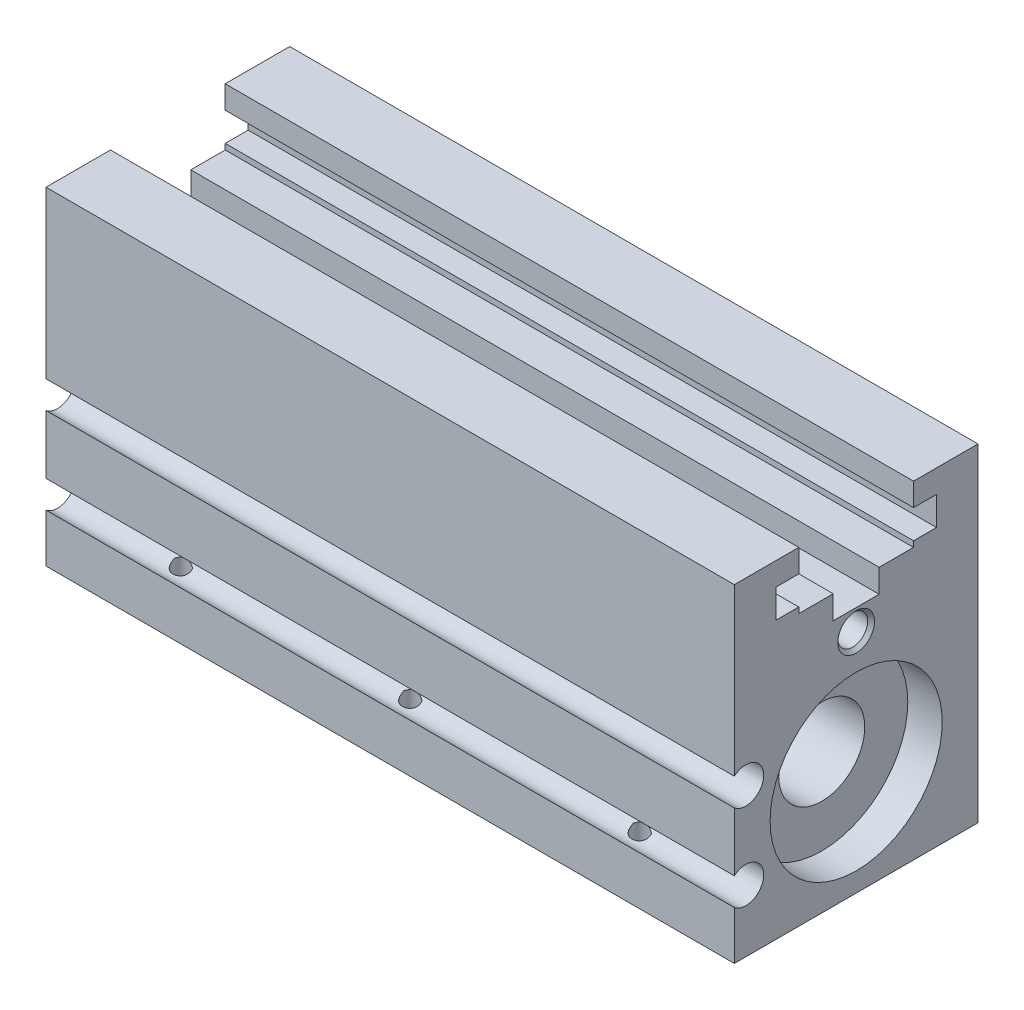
from build123d import *

# Parameters (mm, degrees)
EXTRUDE1_DEPTH     = 76.2
SKETCH2_R          = 9.525
CUT_EXTRUDE1_DEPTH = 3.81
SKETCH3_R          = 1.20269
CUT_EXTRUDE2_DEPTH = 3.048
SKETCH4_R          = 1.20269
CUT_EXTRUDE3_DEPTH = 3.048
CUT_EXTRUDE4_START = 3.81
SKETCH9_R          = 9.525
CUT_EXTRUDE4_DEPTH = 3.81
SKETCH10_W         = 3.81
SKETCH10_H         = 9.3345
SKETCH15_R         = 1.20269
CUT_EXTRUDE5_DEPTH = 3.175
SKETCH16_R         = 1.20269
CUT_EXTRUDE6_DEPTH = 3.175
SKETCH17_R         = 1.20269
CUT_EXTRUDE7_DEPTH = 3.175
SKETCH18_R         = 1.20269
CUT_EXTRUDE8_DEPTH = 3.175
SKETCH20_W         = 60.96
SKETCH20_H         = 4.7625


with BuildPart() as part:
    # Sketch1 → Extrude1 (new body)
    with BuildSketch(Plane(origin=(0, 0, 0), x_dir=(0, 0, -1), z_dir=(1, 0, 0))):
        with BuildLine():
            Line((-13.4874, -18.161), (13.4874, -18.161))
            Line((13.4874, -18.161), (13.4874, 18.161))
            Line((13.4874, 18.161), (6.35, 18.161))
            Line((6.35, 18.161), (6.35, 15.621))
            Line((6.35, 15.621), (8.89, 15.621))
            Line((8.89, 15.621), (8.89, 12.446))
            Line((8.89, 12.446), (6.35, 12.446))
            Line((6.35, 12.446), (6.35, 11.811))
            Line((6.35, 11.811), (2.54, 11.811))
            Line((2.54, 11.811), (2.54, 9.2202))
            Line((2.54, 9.2202), (-2.54, 9.2202))
            Line((-2.54, 9.2202), (-2.54, 11.811))
            Line((-2.54, 11.811), (-6.35, 11.811))
            Line((-6.35, 11.811), (-6.35, 12.446))
            Line((-6.35, 12.446), (-8.89, 12.446))
            Line((-8.89, 12.446), (-8.89, 15.621))
            Line((-8.89, 15.621), (-6.35, 15.621))
            Line((-6.35, 15.621), (-6.35, 18.161))
            Line((-6.35, 18.161), (-13.4874, 18.161))
            Line((-13.4874, 18.161), (-13.4874, -0.206590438))
            ThreePointArc((-13.4874, -0.206590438), (-10.2362, -1.7272), (-13.4874, -3.247809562))
            Line((-13.4874, -3.247809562), (-13.4874, -9.756990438))
            ThreePointArc((-13.4874, -9.756990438), (-10.2362, -11.2776), (-13.4874, -12.798209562))
            Line((-13.4874, -12.798209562), (-13.4874, -18.161))
        make_face()
    extrude(amount=EXTRUDE1_DEPTH)

    # Sketch2 → Cut-Extrude1 (cut)
    with BuildSketch(Plane(origin=(76.2, 0, 0), x_dir=(0, 0, -1), z_dir=(1, 0, 0))):
        with Locations((0, -6.5024)):
            Circle(SKETCH2_R)
    extrude(amount=-CUT_EXTRUDE1_DEPTH, mode=Mode.SUBTRACT)

    # Sketch3 → Cut-Extrude2 (cut)
    with BuildSketch(Plane(origin=(0, 0, 0), x_dir=(0, 0, -1), z_dir=(1, 0, 0))):
        with Locations(Location((10.3251, 8.4582, 0), (0, 0, 180))):
            Circle(SKETCH3_R)
    extrude(amount=CUT_EXTRUDE2_DEPTH, mode=Mode.SUBTRACT)

    # Sketch4 → Cut-Extrude3 (cut)
    with BuildSketch(Plane(origin=(0, 0, 0), x_dir=(0, 0, -1), z_dir=(1, 0, 0))):
        with Locations(Location((-10.3251, -15.367, 0), (0, 0, 180))):
            Circle(SKETCH4_R)
    extrude(amount=CUT_EXTRUDE3_DEPTH, mode=Mode.SUBTRACT)

    # Sketch5 → Cut-Revolve1 (revolve, cut)
    with BuildSketch(Plane.XY.offset(10.3251), mode=Mode.PRIVATE) as cut_revolve1_sk:
        Polygon((0, 8.4582), (0, 9.8552), (0.381, 9.4742), (6.271412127, 9.4742), (6.858, 8.4582), align=None)
    revolve(cut_revolve1_sk.sketch.rotate(Axis((6.858, 8.4582, 10.3251), (-1, 0, 0)), 270), axis=Axis((6.858, 8.4582, 10.3251), (-1, 0, 0)), mode=Mode.SUBTRACT)

    # Sketch6 → Cut-Revolve2 (revolve, cut)
    with BuildSketch(Plane.XY.offset(-10.3251), mode=Mode.PRIVATE) as cut_revolve2_sk:
        Polygon((0, -15.367), (0, -13.97), (0.381, -14.351), (6.271412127, -14.351), (6.858, -15.367), align=None)
    revolve(cut_revolve2_sk.sketch.rotate(Axis((6.858, -15.367, -10.3251), (-1, 0, 0)), 270), axis=Axis((6.858, -15.367, -10.3251), (-1, 0, 0)), mode=Mode.SUBTRACT)

    # Sketch7 → Cut-Revolve3 (revolve, cut)
    with BuildSketch(Plane(origin=(5.715, 0, 0), x_dir=(0, 0, -1), z_dir=(1, 0, 0)), mode=Mode.PRIVATE) as cut_revolve3_sk:
        Polygon((8.9154, 3.8862), (8.9154, 5.8293), (13.0175, 5.8293), (13.4874, 6.2992), (13.4874, 3.8862), align=None)
    revolve(cut_revolve3_sk.sketch.rotate(Axis((5.715, 3.8862, -13.4874), (0, 0, 1)), 270), axis=Axis((5.715, 3.8862, -13.4874), (0, 0, 1)), mode=Mode.SUBTRACT)

    # Sketch8 → Cut-Revolve4 (revolve, cut)
    with BuildSketch(Plane(origin=(67.31, 0, 0), x_dir=(0, 0, -1), z_dir=(1, 0, 0)), mode=Mode.PRIVATE) as cut_revolve4_sk:
        Polygon((8.9154, 3.8862), (8.9154, 5.8293), (13.0175, 5.8293), (13.4874, 6.2992), (13.4874, 3.8862), align=None)
    revolve(cut_revolve4_sk.sketch.rotate(Axis((67.31, 3.8862, -13.4874), (0, 0, 1)), 270), axis=Axis((67.31, 3.8862, -13.4874), (0, 0, 1)), mode=Mode.SUBTRACT)

    # Sketch9 → Cut-Extrude4 (cut)
    with BuildSketch(Plane(origin=(0, 0, 0), x_dir=(0, 0, -1), z_dir=(1, 0, 0)).offset(CUT_EXTRUDE4_START)):
        with Locations((0, -6.5024)):
            Circle(SKETCH9_R)
    extrude(amount=-CUT_EXTRUDE4_DEPTH, mode=Mode.SUBTRACT)

    # Sketch10 → Revolve1 (revolve)
    with BuildSketch(Plane.XY, mode=Mode.PRIVATE) as revolve1_sk:
        with Locations((1.905, -1.83515)):
            Rectangle(SKETCH10_W, SKETCH10_H)
    revolve(revolve1_sk.sketch.rotate(Axis((3.81, -6.5024, 0), (-1, 0, 0)), 270), axis=Axis((3.81, -6.5024, 0), (-1, 0, 0)))

    # Sketch11 → Cut-Revolve5 (revolve, cut)
    with BuildSketch(Plane(origin=(12.7, 0, 0), x_dir=(0, 0, -1), z_dir=(1, 0, 0)), mode=Mode.PRIVATE) as cut_revolve5_sk:
        Polygon((-11.1125, -18.161), (-12.5095, -18.161), (-12.1285, -17.78), (-12.1285, -12.803987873), (-11.1125, -12.2174), align=None)
    revolve(cut_revolve5_sk.sketch.rotate(Axis((12.7, -12.2174, 11.1125), (0, -1, 0)), 180), axis=Axis((12.7, -12.2174, 11.1125), (0, -1, 0)), mode=Mode.SUBTRACT)

    # Sketch12 → Cut-Revolve6 (revolve, cut)
    with BuildSketch(Plane(origin=(63.5, 0, 0), x_dir=(0, 0, -1), z_dir=(1, 0, 0)), mode=Mode.PRIVATE) as cut_revolve6_sk:
        Polygon((-11.1125, -18.161), (-12.5095, -18.161), (-12.1285, -17.78), (-12.1285, -12.803987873), (-11.1125, -12.2174), align=None)
    revolve(cut_revolve6_sk.sketch.rotate(Axis((63.5, -12.2174, 11.1125), (0, -1, 0)), 180), axis=Axis((63.5, -12.2174, 11.1125), (0, -1, 0)), mode=Mode.SUBTRACT)

    # Sketch13 → Cut-Revolve7 (revolve, cut)
    with BuildSketch(Plane(origin=(63.5, 0, 0), x_dir=(0, 0, -1), z_dir=(1, 0, 0)), mode=Mode.PRIVATE) as cut_revolve7_sk:
        Polygon((11.1125, -18.161), (9.7155, -18.161), (10.0965, -17.78), (10.0965, -12.803987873), (11.1125, -12.2174), align=None)
    revolve(cut_revolve7_sk.sketch.rotate(Axis((63.5, -12.2174, -11.1125), (0, -1, 0)), 180), axis=Axis((63.5, -12.2174, -11.1125), (0, -1, 0)), mode=Mode.SUBTRACT)

    # Sketch14 → Cut-Revolve8 (revolve, cut)
    with BuildSketch(Plane(origin=(12.7, 0, 0), x_dir=(0, 0, -1), z_dir=(1, 0, 0)), mode=Mode.PRIVATE) as cut_revolve8_sk:
        Polygon((11.1125, -18.161), (9.7155, -18.161), (10.0965, -17.78), (10.0965, -12.803987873), (11.1125, -12.2174), align=None)
    revolve(cut_revolve8_sk.sketch.rotate(Axis((12.7, -12.2174, -11.1125), (0, -1, 0)), 180), axis=Axis((12.7, -12.2174, -11.1125), (0, -1, 0)), mode=Mode.SUBTRACT)

    # Sketch15 → Cut-Extrude5 (cut)
    with BuildSketch(Plane(origin=(0, -18.161, 0), x_dir=(-1, 0, 0), z_dir=(0, 1, 0))):
        with Locations(Location((-19.05, 11.1125, 0), (0, 0, 90))):
            Circle(SKETCH15_R)
    extrude(amount=CUT_EXTRUDE5_DEPTH, mode=Mode.SUBTRACT)

    # Sketch16 → Cut-Extrude6 (cut)
    with BuildSketch(Plane(origin=(0, -18.161, 0), x_dir=(-1, 0, 0), z_dir=(0, 1, 0))):
        with Locations(Location((-57.15, 11.1125, 0), (0, 0, 90))):
            Circle(SKETCH16_R)
    extrude(amount=CUT_EXTRUDE6_DEPTH, mode=Mode.SUBTRACT)

    # Sketch17 → Cut-Extrude7 (cut)
    with BuildSketch(Plane(origin=(0, -18.161, 0), x_dir=(-1, 0, 0), z_dir=(0, 1, 0))):
        with Locations(Location((-57.15, -11.1125, 0), (0, 0, 90))):
            Circle(SKETCH17_R)
    extrude(amount=CUT_EXTRUDE7_DEPTH, mode=Mode.SUBTRACT)

    # Sketch18 → Cut-Extrude8 (cut)
    with BuildSketch(Plane(origin=(0, -18.161, 0), x_dir=(-1, 0, 0), z_dir=(0, 1, 0))):
        with Locations(Location((-19.05, -11.1125, 0), (0, 0, 90))):
            Circle(SKETCH18_R)
    extrude(amount=CUT_EXTRUDE8_DEPTH, mode=Mode.SUBTRACT)

    # Sketch19 → Cut-Revolve9 (revolve, cut)
    with BuildSketch(Plane.XY, mode=Mode.PRIVATE) as cut_revolve9_sk:
        Polygon((0, 5.360924), (0, 7.392924), (0.381, 7.011924), (3.048, 7.011924), (3.048, 5.360924), align=None)
    revolve(cut_revolve9_sk.sketch.rotate(Axis((3.048, 5.360924, 0), (-1, 0, 0)), 270), axis=Axis((3.048, 5.360924, 0), (-1, 0, 0)), mode=Mode.SUBTRACT)

    # Sketch20 → Cut-Revolve10 (revolve, cut)
    with BuildSketch(Plane.XY, mode=Mode.PRIVATE) as cut_revolve10_sk:
        with Locations((41.91, -4.12115)):
            Rectangle(SKETCH20_W, SKETCH20_H)
    revolve(cut_revolve10_sk.sketch.rotate(Axis((72.39, -6.5024, 0), (-1, 0, 0)), 270), axis=Axis((72.39, -6.5024, 0), (-1, 0, 0)), mode=Mode.SUBTRACT)

    # Sketch21 → Cut-Revolve11 (revolve, cut)
    with BuildSketch(Plane.XY, mode=Mode.PRIVATE) as cut_revolve11_sk:
        Polygon((73.152, 6.8834), (73.152, 8.5344), (75.819, 8.5344), (76.2, 8.9154), (76.2, 6.8834), align=None)
    revolve(cut_revolve11_sk.sketch.rotate(Axis((76.2, 6.8834, 0), (-1, 0, 0)), 270), axis=Axis((76.2, 6.8834, 0), (-1, 0, 0)), mode=Mode.SUBTRACT)

    # Sketch22 → Cut-Revolve12 (revolve, cut)
    with BuildSketch(Plane(origin=(38.1, 0, 0), x_dir=(0, 0, -1), z_dir=(1, 0, 0)), mode=Mode.PRIVATE) as cut_revolve12_sk:
        Polygon((-11.1125, -18.161), (-12.5095, -18.161), (-12.1285, -17.78), (-12.1285, -12.803987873), (-11.1125, -12.2174), align=None)
    revolve(cut_revolve12_sk.sketch.rotate(Axis((38.1, -12.2174, 11.1125), (0, -1, 0)), 180), axis=Axis((38.1, -12.2174, 11.1125), (0, -1, 0)), mode=Mode.SUBTRACT)

    # Sketch23 → Cut-Revolve13 (revolve, cut)
    with BuildSketch(Plane(origin=(38.1, 0, 0), x_dir=(0, 0, -1), z_dir=(1, 0, 0)), mode=Mode.PRIVATE) as cut_revolve13_sk:
        Polygon((11.1125, -18.161), (9.7155, -18.161), (10.0965, -17.78), (10.0965, -12.803987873), (11.1125, -12.2174), align=None)
    revolve(cut_revolve13_sk.sketch.rotate(Axis((38.1, -12.2174, -11.1125), (0, -1, 0)), 180), axis=Axis((38.1, -12.2174, -11.1125), (0, -1, 0)), mode=Mode.SUBTRACT)


solid = part.part
